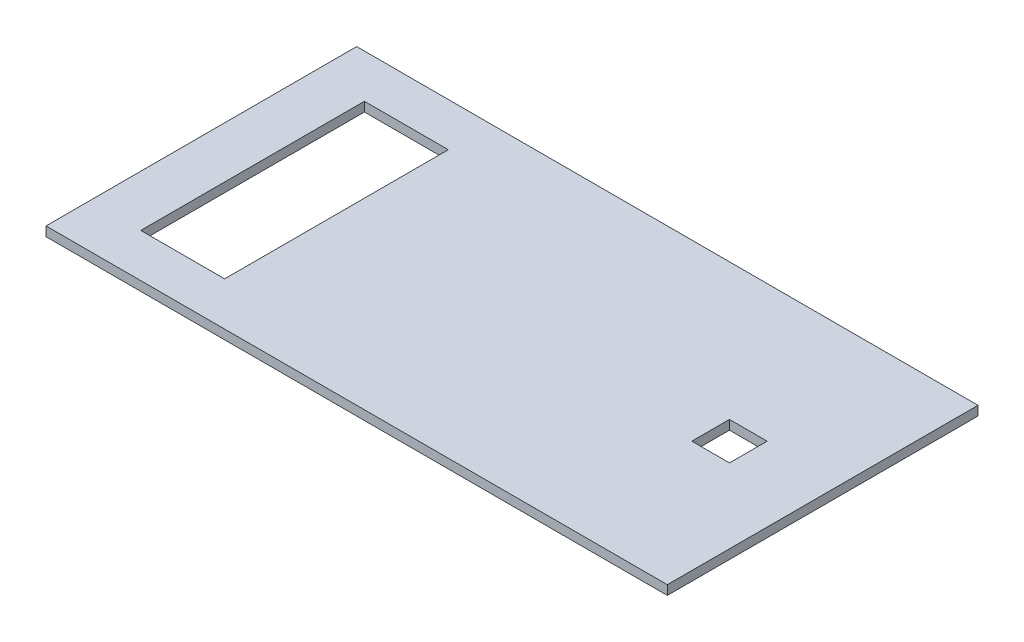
from build123d import *

# Parameters (mm, degrees)
SKETCH1_W           = 200
SKETCH1_H           = 3
BOSS_EXTRUDE1_DEPTH = 100
SKETCH2_W           = 27
SKETCH2_H           = 72
SKETCH2_W_2         = 12.12
SKETCH2_H_2         = 12.12
CUT_EXTRUDE1_DEPTH  = 100


with BuildPart() as part:
    # Sketch1 → Boss-Extrude1 (new body)
    with BuildSketch(Plane.XY):
        Rectangle(SKETCH1_W, SKETCH1_H)
    extrude(amount=BOSS_EXTRUDE1_DEPTH)

    # Sketch2 → Cut-Extrude1 (cut)
    with BuildSketch(Plane(origin=(0, 1.5, 0), x_dir=(1, 0, 0), z_dir=(0, 1, 0))):
        with Locations((-70, -50)):
            Rectangle(SKETCH2_W, SKETCH2_H)
        with Locations((70, -50)):
            Rectangle(SKETCH2_W_2, SKETCH2_H_2)
    extrude(amount=-CUT_EXTRUDE1_DEPTH, mode=Mode.SUBTRACT)


solid = part.part
